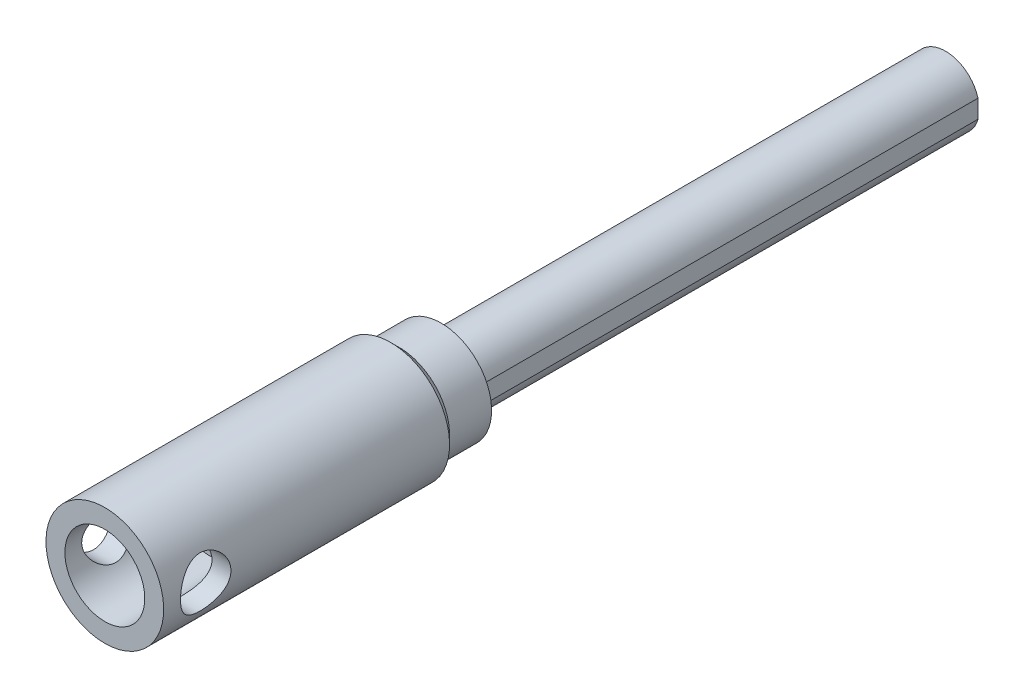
ISO-10303-21;
HEADER;
FILE_DESCRIPTION(('STEP AP214'),'2;1');
FILE_NAME('part.step','',(''),(''),'','','');
FILE_SCHEMA(('AUTOMOTIVE_DESIGN { 1 0 10303 214 1 1 1 1 }'));
ENDSEC;
DATA;
#1=APPLICATION_CONTEXT('core data for automotive mechanical design processes');
#2=APPLICATION_PROTOCOL_DEFINITION('international standard','automotive_design',2000,#1);
#3=PRODUCT_CONTEXT('',#1,'mechanical');
#4=PRODUCT('Part','Part','',(#3));
#5=PRODUCT_RELATED_PRODUCT_CATEGORY('part','',(#4));
#6=PRODUCT_DEFINITION_FORMATION('','',#4);
#7=PRODUCT_DEFINITION_CONTEXT('part definition',#1,'design');
#8=PRODUCT_DEFINITION('design','',#6,#7);
#9=PRODUCT_DEFINITION_SHAPE('','',#8);
#10=(LENGTH_UNIT() NAMED_UNIT(*) SI_UNIT(.MILLI.,.METRE.));
#11=(NAMED_UNIT(*) PLANE_ANGLE_UNIT() SI_UNIT($,.RADIAN.));
#12=(NAMED_UNIT(*) SI_UNIT($,.STERADIAN.) SOLID_ANGLE_UNIT());
#13=UNCERTAINTY_MEASURE_WITH_UNIT(LENGTH_MEASURE(1.E-05),#10,'distance_accuracy_value','');
#14=(GEOMETRIC_REPRESENTATION_CONTEXT(3) GLOBAL_UNCERTAINTY_ASSIGNED_CONTEXT((#13)) GLOBAL_UNIT_ASSIGNED_CONTEXT((#10,
#11,#12)) REPRESENTATION_CONTEXT('',''));
#15=CARTESIAN_POINT('',(0.,0.,0.));
#16=DIRECTION('',(0.,0.,1.));
#17=DIRECTION('',(1.,0.,0.));
#18=AXIS2_PLACEMENT_3D('',#15,#16,#17);
#19=CARTESIAN_POINT('',(2.3094010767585,0.,85.));
#20=DIRECTION('',(-0.866025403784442,0.5,0.));
#21=DIRECTION('',(-0.5,-0.866025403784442,0.));
#22=AXIS2_PLACEMENT_3D('',#19,#20,#21);
#23=PLANE('',#22);
#24=DIRECTION('',(0.,0.,1.));
#25=VECTOR('',#24,1.);
#26=CARTESIAN_POINT('',(1.15470053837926,-2.,85.));
#27=LINE('',#26,#25);
#28=CARTESIAN_POINT('',(1.15470053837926,-2.,85.));
#29=VERTEX_POINT('',#28);
#30=CARTESIAN_POINT('',(1.15470053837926,-2.,87.5));
#31=VERTEX_POINT('',#30);
#32=EDGE_CURVE('E273',#29,#31,#27,.T.);
#33=ORIENTED_EDGE('',*,*,#32,.T.);
#34=DIRECTION('',(-0.5,-0.866025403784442,0.));
#35=VECTOR('',#34,1.);
#36=CARTESIAN_POINT('',(2.3094010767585,0.,87.5));
#37=LINE('',#36,#35);
#38=CARTESIAN_POINT('',(2.3094010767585,0.,87.5));
#39=VERTEX_POINT('',#38);
#40=EDGE_CURVE('E29',#39,#31,#37,.T.);
#41=ORIENTED_EDGE('',*,*,#40,.F.);
#42=DIRECTION('',(0.,0.,1.));
#43=VECTOR('',#42,1.);
#44=CARTESIAN_POINT('',(2.3094010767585,0.,85.));
#45=LINE('',#44,#43);
#46=CARTESIAN_POINT('',(2.3094010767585,0.,85.));
#47=VERTEX_POINT('',#46);
#48=EDGE_CURVE('E33',#47,#39,#45,.T.);
#49=ORIENTED_EDGE('',*,*,#48,.F.);
#50=DIRECTION('',(-0.5,-0.866025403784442,0.));
#51=VECTOR('',#50,1.);
#52=CARTESIAN_POINT('',(2.3094010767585,0.,85.));
#53=LINE('',#52,#51);
#54=EDGE_CURVE('E234',#47,#29,#53,.T.);
#55=ORIENTED_EDGE('',*,*,#54,.T.);
#56=EDGE_LOOP('',(#33,#41,#49,#55));
#57=FACE_BOUND('',#56,.T.);
#58=ADVANCED_FACE('F14',(#57),#23,.T.);
#59=CARTESIAN_POINT('',(-1.15470053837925,-2.,85.));
#60=DIRECTION('',(0.,-1.,0.));
#61=DIRECTION('',(0.,0.,-1.));
#62=AXIS2_PLACEMENT_3D('',#59,#60,#61);
#63=PLANE('',#62);
#64=DIRECTION('',(0.,0.,1.));
#65=VECTOR('',#64,1.);
#66=CARTESIAN_POINT('',(-1.15470053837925,-2.,85.));
#67=LINE('',#66,#65);
#68=CARTESIAN_POINT('',(-1.15470053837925,-2.,85.));
#69=VERTEX_POINT('',#68);
#70=CARTESIAN_POINT('',(-1.15470053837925,-2.,87.5));
#71=VERTEX_POINT('',#70);
#72=EDGE_CURVE('E271',#69,#71,#67,.T.);
#73=ORIENTED_EDGE('',*,*,#72,.T.);
#74=DIRECTION('',(1.,0.,0.));
#75=VECTOR('',#74,1.);
#76=CARTESIAN_POINT('',(-1.15470053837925,-2.,87.5));
#77=LINE('',#76,#75);
#78=EDGE_CURVE('E244',#71,#31,#77,.T.);
#79=ORIENTED_EDGE('',*,*,#78,.T.);
#80=ORIENTED_EDGE('',*,*,#32,.F.);
#81=DIRECTION('',(1.,0.,0.));
#82=VECTOR('',#81,1.);
#83=CARTESIAN_POINT('',(-1.15470053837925,-2.,85.));
#84=LINE('',#83,#82);
#85=EDGE_CURVE('E260',#69,#29,#84,.T.);
#86=ORIENTED_EDGE('',*,*,#85,.F.);
#87=EDGE_LOOP('',(#73,#79,#80,#86));
#88=FACE_BOUND('',#87,.T.);
#89=ADVANCED_FACE('F164',(#88),#63,.F.);
#90=CARTESIAN_POINT('',(-2.3094010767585,0.,85.));
#91=DIRECTION('',(-0.866025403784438,-0.5,0.));
#92=DIRECTION('',(0.5,-0.866025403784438,0.));
#93=AXIS2_PLACEMENT_3D('',#90,#91,#92);
#94=PLANE('',#93);
#95=DIRECTION('',(0.,0.,1.));
#96=VECTOR('',#95,1.);
#97=CARTESIAN_POINT('',(-2.3094010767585,0.,85.));
#98=LINE('',#97,#96);
#99=CARTESIAN_POINT('',(-2.3094010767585,0.,85.));
#100=VERTEX_POINT('',#99);
#101=CARTESIAN_POINT('',(-2.3094010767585,0.,87.5));
#102=VERTEX_POINT('',#101);
#103=EDGE_CURVE('E269',#100,#102,#98,.T.);
#104=ORIENTED_EDGE('',*,*,#103,.T.);
#105=DIRECTION('',(0.5,-0.866025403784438,0.));
#106=VECTOR('',#105,1.);
#107=CARTESIAN_POINT('',(-2.3094010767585,0.,87.5));
#108=LINE('',#107,#106);
#109=EDGE_CURVE('E241',#102,#71,#108,.T.);
#110=ORIENTED_EDGE('',*,*,#109,.T.);
#111=ORIENTED_EDGE('',*,*,#72,.F.);
#112=DIRECTION('',(0.5,-0.866025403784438,0.));
#113=VECTOR('',#112,1.);
#114=CARTESIAN_POINT('',(-2.3094010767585,0.,85.));
#115=LINE('',#114,#113);
#116=EDGE_CURVE('E257',#100,#69,#115,.T.);
#117=ORIENTED_EDGE('',*,*,#116,.F.);
#118=EDGE_LOOP('',(#104,#110,#111,#117));
#119=FACE_BOUND('',#118,.T.);
#120=ADVANCED_FACE('F169',(#119),#94,.F.);
#121=CARTESIAN_POINT('',(-2.3094010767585,0.,85.));
#122=DIRECTION('',(0.866025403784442,-0.5,0.));
#123=DIRECTION('',(0.5,0.866025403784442,0.));
#124=AXIS2_PLACEMENT_3D('',#121,#122,#123);
#125=PLANE('',#124);
#126=DIRECTION('',(0.,0.,1.));
#127=VECTOR('',#126,1.);
#128=CARTESIAN_POINT('',(-1.15470053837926,2.,85.));
#129=LINE('',#128,#127);
#130=CARTESIAN_POINT('',(-1.15470053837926,2.,85.));
#131=VERTEX_POINT('',#130);
#132=CARTESIAN_POINT('',(-1.15470053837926,2.,87.5));
#133=VERTEX_POINT('',#132);
#134=EDGE_CURVE('E267',#131,#133,#129,.T.);
#135=ORIENTED_EDGE('',*,*,#134,.T.);
#136=DIRECTION('',(0.5,0.866025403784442,0.));
#137=VECTOR('',#136,1.);
#138=CARTESIAN_POINT('',(-2.3094010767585,0.,87.5));
#139=LINE('',#138,#137);
#140=EDGE_CURVE('E238',#102,#133,#139,.T.);
#141=ORIENTED_EDGE('',*,*,#140,.F.);
#142=ORIENTED_EDGE('',*,*,#103,.F.);
#143=DIRECTION('',(0.5,0.866025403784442,0.));
#144=VECTOR('',#143,1.);
#145=CARTESIAN_POINT('',(-2.3094010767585,0.,85.));
#146=LINE('',#145,#144);
#147=EDGE_CURVE('E254',#100,#131,#146,.T.);
#148=ORIENTED_EDGE('',*,*,#147,.T.);
#149=EDGE_LOOP('',(#135,#141,#142,#148));
#150=FACE_BOUND('',#149,.T.);
#151=ADVANCED_FACE('F183',(#150),#125,.T.);
#152=CARTESIAN_POINT('',(1.15470053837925,2.,85.));
#153=DIRECTION('',(0.,1.,0.));
#154=DIRECTION('',(-1.,0.,0.));
#155=AXIS2_PLACEMENT_3D('',#152,#153,#154);
#156=PLANE('',#155);
#157=DIRECTION('',(0.,0.,1.));
#158=VECTOR('',#157,1.);
#159=CARTESIAN_POINT('',(1.15470053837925,2.,85.));
#160=LINE('',#159,#158);
#161=CARTESIAN_POINT('',(1.15470053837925,2.,85.));
#162=VERTEX_POINT('',#161);
#163=CARTESIAN_POINT('',(1.15470053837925,2.,87.5));
#164=VERTEX_POINT('',#163);
#165=EDGE_CURVE('E265',#162,#164,#160,.T.);
#166=ORIENTED_EDGE('',*,*,#165,.T.);
#167=DIRECTION('',(-1.,0.,0.));
#168=VECTOR('',#167,1.);
#169=CARTESIAN_POINT('',(1.15470053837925,2.,87.5));
#170=LINE('',#169,#168);
#171=EDGE_CURVE('E235',#164,#133,#170,.T.);
#172=ORIENTED_EDGE('',*,*,#171,.T.);
#173=ORIENTED_EDGE('',*,*,#134,.F.);
#174=DIRECTION('',(-1.,0.,0.));
#175=VECTOR('',#174,1.);
#176=CARTESIAN_POINT('',(1.15470053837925,2.,85.));
#177=LINE('',#176,#175);
#178=EDGE_CURVE('E251',#162,#131,#177,.T.);
#179=ORIENTED_EDGE('',*,*,#178,.F.);
#180=EDGE_LOOP('',(#166,#172,#173,#179));
#181=FACE_BOUND('',#180,.T.);
#182=ADVANCED_FACE('F179',(#181),#156,.F.);
#183=CARTESIAN_POINT('',(2.3094010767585,0.,85.));
#184=DIRECTION('',(0.866025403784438,0.5,0.));
#185=DIRECTION('',(-0.5,0.866025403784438,0.));
#186=AXIS2_PLACEMENT_3D('',#183,#184,#185);
#187=PLANE('',#186);
#188=DIRECTION('',(-0.5,0.866025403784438,0.));
#189=VECTOR('',#188,1.);
#190=CARTESIAN_POINT('',(2.3094010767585,0.,85.));
#191=LINE('',#190,#189);
#192=EDGE_CURVE('E248',#47,#162,#191,.T.);
#193=ORIENTED_EDGE('',*,*,#192,.F.);
#194=ORIENTED_EDGE('',*,*,#48,.T.);
#195=DIRECTION('',(-0.5,0.866025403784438,0.));
#196=VECTOR('',#195,1.);
#197=CARTESIAN_POINT('',(2.3094010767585,0.,87.5));
#198=LINE('',#197,#196);
#199=EDGE_CURVE('E231',#39,#164,#198,.T.);
#200=ORIENTED_EDGE('',*,*,#199,.T.);
#201=ORIENTED_EDGE('',*,*,#165,.F.);
#202=EDGE_LOOP('',(#193,#194,#200,#201));
#203=FACE_BOUND('',#202,.T.);
#204=ADVANCED_FACE('F176',(#203),#187,.F.);
#205=CARTESIAN_POINT('',(3.46410161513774,2.,85.));
#206=DIRECTION('',(0.,0.,-1.));
#207=DIRECTION('',(0.,1.,0.));
#208=AXIS2_PLACEMENT_3D('',#205,#206,#207);
#209=PLANE('',#208);
#210=ORIENTED_EDGE('',*,*,#54,.F.);
#211=ORIENTED_EDGE('',*,*,#192,.T.);
#212=ORIENTED_EDGE('',*,*,#178,.T.);
#213=ORIENTED_EDGE('',*,*,#147,.F.);
#214=ORIENTED_EDGE('',*,*,#116,.T.);
#215=ORIENTED_EDGE('',*,*,#85,.T.);
#216=EDGE_LOOP('',(#210,#211,#212,#213,#214,#215));
#217=FACE_BOUND('',#216,.T.);
#218=ADVANCED_FACE('F174',(#217),#209,.F.);
#219=CARTESIAN_POINT('',(0.,0.,87.5));
#220=DIRECTION('',(0.,0.,1.));
#221=DIRECTION('',(0.,-1.,0.));
#222=AXIS2_PLACEMENT_3D('',#219,#220,#221);
#223=PLANE('',#222);
#224=CARTESIAN_POINT('',(0.,0.,87.5));
#225=DIRECTION('',(0.,0.,1.));
#226=DIRECTION('',(0.,-1.,0.));
#227=AXIS2_PLACEMENT_3D('',#224,#225,#226);
#228=CIRCLE('',#227,4.25);
#229=CARTESIAN_POINT('',(0.,-4.25,87.5));
#230=VERTEX_POINT('',#229);
#231=EDGE_CURVE('E9',#230,#230,#228,.T.);
#232=ORIENTED_EDGE('',*,*,#231,.T.);
#233=EDGE_LOOP('',(#232));
#234=FACE_BOUND('',#233,.T.);
#235=ORIENTED_EDGE('',*,*,#199,.F.);
#236=ORIENTED_EDGE('',*,*,#40,.T.);
#237=ORIENTED_EDGE('',*,*,#78,.F.);
#238=ORIENTED_EDGE('',*,*,#109,.F.);
#239=ORIENTED_EDGE('',*,*,#140,.T.);
#240=ORIENTED_EDGE('',*,*,#171,.F.);
#241=EDGE_LOOP('',(#235,#236,#237,#238,#239,#240));
#242=FACE_BOUND('',#241,.T.);
#243=ADVANCED_FACE('F16',(#234,#242),#223,.T.);
#244=CARTESIAN_POINT('',(0.,0.,82.5));
#245=DIRECTION('',(0.,0.,1.));
#246=DIRECTION('',(0.,-1.,0.));
#247=AXIS2_PLACEMENT_3D('',#244,#245,#246);
#248=CYLINDRICAL_SURFACE('',#247,4.25);
#249=CARTESIAN_POINT('',(0.,0.,82.5));
#250=DIRECTION('',(0.,0.,1.));
#251=DIRECTION('',(0.,-1.,0.));
#252=AXIS2_PLACEMENT_3D('',#249,#250,#251);
#253=CIRCLE('',#252,4.25);
#254=CARTESIAN_POINT('',(0.,-4.25,82.5));
#255=VERTEX_POINT('',#254);
#256=EDGE_CURVE('E22',#255,#255,#253,.T.);
#257=ORIENTED_EDGE('',*,*,#256,.T.);
#258=EDGE_LOOP('',(#257));
#259=FACE_BOUND('',#258,.T.);
#260=ORIENTED_EDGE('',*,*,#231,.F.);
#261=EDGE_LOOP('',(#260));
#262=FACE_BOUND('',#261,.T.);
#263=ADVANCED_FACE('F190',(#259,#262),#248,.T.);
#264=CARTESIAN_POINT('',(0.,0.,0.));
#265=DIRECTION('',(0.,0.,1.));
#266=DIRECTION('',(-1.,0.,0.));
#267=AXIS2_PLACEMENT_3D('',#264,#265,#266);
#268=PLANE('',#267);
#269=DIRECTION('',(0.,-1.,0.));
#270=VECTOR('',#269,1.);
#271=CARTESIAN_POINT('',(3.85,-1.08512672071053,0.));
#272=LINE('',#271,#270);
#273=CARTESIAN_POINT('',(3.85,1.08512672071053,0.));
#274=VERTEX_POINT('',#273);
#275=CARTESIAN_POINT('',(3.85,-1.08512672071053,0.));
#276=VERTEX_POINT('',#275);
#277=EDGE_CURVE('E91',#274,#276,#272,.T.);
#278=ORIENTED_EDGE('',*,*,#277,.T.);
#279=CARTESIAN_POINT('',(0.,0.,0.));
#280=DIRECTION('',(0.,0.,1.));
#281=DIRECTION('',(-1.,0.,0.));
#282=AXIS2_PLACEMENT_3D('',#279,#280,#281);
#283=CIRCLE('',#282,4.);
#284=EDGE_CURVE('E83',#274,#276,#283,.T.);
#285=ORIENTED_EDGE('',*,*,#284,.F.);
#286=EDGE_LOOP('',(#278,#285));
#287=FACE_BOUND('',#286,.T.);
#288=ADVANCED_FACE('F95',(#287),#268,.F.);
#289=CARTESIAN_POINT('',(3.85,-1.08512672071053,70.));
#290=DIRECTION('',(1.,0.,0.));
#291=DIRECTION('',(0.,0.,1.));
#292=AXIS2_PLACEMENT_3D('',#289,#290,#291);
#293=PLANE('',#292);
#294=DIRECTION('',(0.,1.,0.));
#295=VECTOR('',#294,1.);
#296=CARTESIAN_POINT('',(3.85,5.9999999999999,60.));
#297=LINE('',#296,#295);
#298=CARTESIAN_POINT('',(3.85,-1.08512672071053,60.));
#299=VERTEX_POINT('',#298);
#300=CARTESIAN_POINT('',(3.85,1.08512672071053,60.));
#301=VERTEX_POINT('',#300);
#302=EDGE_CURVE('E226',#299,#301,#297,.T.);
#303=ORIENTED_EDGE('',*,*,#302,.F.);
#304=DIRECTION('',(0.,0.,-1.));
#305=VECTOR('',#304,1.);
#306=CARTESIAN_POINT('',(3.85,-1.08512672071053,70.));
#307=LINE('',#306,#305);
#308=EDGE_CURVE('E88',#299,#276,#307,.T.);
#309=ORIENTED_EDGE('',*,*,#308,.T.);
#310=ORIENTED_EDGE('',*,*,#277,.F.);
#311=DIRECTION('',(0.,0.,-1.));
#312=VECTOR('',#311,1.);
#313=CARTESIAN_POINT('',(3.85,1.08512672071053,70.));
#314=LINE('',#313,#312);
#315=EDGE_CURVE('E78',#301,#274,#314,.T.);
#316=ORIENTED_EDGE('',*,*,#315,.F.);
#317=EDGE_LOOP('',(#303,#309,#310,#316));
#318=FACE_BOUND('',#317,.T.);
#319=ADVANCED_FACE('F92',(#318),#293,.T.);
#320=CARTESIAN_POINT('',(0.,0.,70.));
#321=DIRECTION('',(0.,0.,-1.));
#322=DIRECTION('',(1.,0.,0.));
#323=AXIS2_PLACEMENT_3D('',#320,#321,#322);
#324=CYLINDRICAL_SURFACE('',#323,4.);
#325=ORIENTED_EDGE('',*,*,#308,.F.);
#326=CARTESIAN_POINT('',(0.,0.,60.));
#327=DIRECTION('',(0.,0.,1.));
#328=DIRECTION('',(-6.15310496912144E-10,1.,0.));
#329=AXIS2_PLACEMENT_3D('',#326,#327,#328);
#330=CIRCLE('',#329,4.);
#331=EDGE_CURVE('E84',#299,#301,#330,.F.);
#332=ORIENTED_EDGE('',*,*,#331,.T.);
#333=ORIENTED_EDGE('',*,*,#315,.T.);
#334=ORIENTED_EDGE('',*,*,#284,.T.);
#335=EDGE_LOOP('',(#325,#332,#333,#334));
#336=FACE_BOUND('',#335,.T.);
#337=ADVANCED_FACE('F81',(#336),#324,.T.);
#338=CARTESIAN_POINT('',(0.,5.99999999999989,60.));
#339=DIRECTION('',(0.,0.,1.));
#340=DIRECTION('',(0.,-1.,0.));
#341=AXIS2_PLACEMENT_3D('',#338,#339,#340);
#342=PLANE('',#341);
#343=CARTESIAN_POINT('',(0.,0.,60.));
#344=DIRECTION('',(0.,0.,1.));
#345=DIRECTION('',(0.,-1.,0.));
#346=AXIS2_PLACEMENT_3D('',#343,#344,#345);
#347=CIRCLE('',#346,5.99999999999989);
#348=CARTESIAN_POINT('',(0.,-5.99999999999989,60.));
#349=VERTEX_POINT('',#348);
#350=EDGE_CURVE('E221',#349,#349,#347,.T.);
#351=ORIENTED_EDGE('',*,*,#350,.F.);
#352=EDGE_LOOP('',(#351));
#353=FACE_BOUND('',#352,.T.);
#354=ORIENTED_EDGE('',*,*,#331,.F.);
#355=ORIENTED_EDGE('',*,*,#302,.T.);
#356=EDGE_LOOP('',(#354,#355));
#357=FACE_BOUND('',#356,.T.);
#358=ADVANCED_FACE('F327',(#353,#357),#342,.F.);
#359=CARTESIAN_POINT('',(0.,0.,102.759686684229));
#360=DIRECTION('',(0.,0.,1.));
#361=DIRECTION('',(0.,-1.,0.));
#362=AXIS2_PLACEMENT_3D('',#359,#360,#361);
#363=CYLINDRICAL_SURFACE('',#362,5.99999999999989);
#364=CARTESIAN_POINT('',(0.,0.,65.));
#365=DIRECTION('',(0.,0.,1.));
#366=DIRECTION('',(0.,-1.,0.));
#367=AXIS2_PLACEMENT_3D('',#364,#365,#366);
#368=CIRCLE('',#367,5.99999999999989);
#369=CARTESIAN_POINT('',(0.,-5.99999999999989,65.));
#370=VERTEX_POINT('',#369);
#371=EDGE_CURVE('E219',#370,#370,#368,.T.);
#372=ORIENTED_EDGE('',*,*,#371,.F.);
#373=EDGE_LOOP('',(#372));
#374=FACE_BOUND('',#373,.T.);
#375=ORIENTED_EDGE('',*,*,#350,.T.);
#376=EDGE_LOOP('',(#375));
#377=FACE_BOUND('',#376,.T.);
#378=ADVANCED_FACE('F335',(#374,#377),#363,.T.);
#379=CARTESIAN_POINT('',(0.,0.,66.));
#380=DIRECTION('',(0.,0.,1.));
#381=DIRECTION('',(0.,-1.,0.));
#382=AXIS2_PLACEMENT_3D('',#379,#380,#381);
#383=CONICAL_SURFACE('',#382,7.0000000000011,0.78539816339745);
#384=ORIENTED_EDGE('',*,*,#371,.T.);
#385=EDGE_LOOP('',(#384));
#386=FACE_BOUND('',#385,.T.);
#387=CARTESIAN_POINT('',(0.,0.,66.));
#388=DIRECTION('',(0.,0.,1.));
#389=DIRECTION('',(0.,-1.,0.));
#390=AXIS2_PLACEMENT_3D('',#387,#388,#389);
#391=CIRCLE('',#390,7.0000000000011);
#392=CARTESIAN_POINT('',(0.,-7.0000000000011,66.));
#393=VERTEX_POINT('',#392);
#394=EDGE_CURVE('E145',#393,#393,#391,.T.);
#395=ORIENTED_EDGE('',*,*,#394,.F.);
#396=EDGE_LOOP('',(#395));
#397=FACE_BOUND('',#396,.T.);
#398=ADVANCED_FACE('F128',(#386,#397),#383,.T.);
#399=CARTESIAN_POINT('',(0.,0.,102.759686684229));
#400=DIRECTION('',(0.,0.,1.));
#401=DIRECTION('',(0.,-1.,0.));
#402=AXIS2_PLACEMENT_3D('',#399,#400,#401);
#403=CYLINDRICAL_SURFACE('',#402,7.0000000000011);
#404=ORIENTED_EDGE('',*,*,#394,.T.);
#405=EDGE_LOOP('',(#404));
#406=FACE_BOUND('',#405,.T.);
#407=CARTESIAN_POINT('',(-7.0000000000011,1.09818090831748E-12,98.));
#408=CARTESIAN_POINT('',(-6.99999408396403,-0.160281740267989,97.9999925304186));
#409=CARTESIAN_POINT('',(-6.9944325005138,-0.320833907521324,97.9870786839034));
#410=CARTESIAN_POINT('',(-6.97273920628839,-0.637349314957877,97.9359176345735));
#411=CARTESIAN_POINT('',(-6.95658080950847,-0.793299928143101,97.8976064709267));
#412=CARTESIAN_POINT('',(-6.91541630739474,-1.09553470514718,97.7973302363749));
#413=CARTESIAN_POINT('',(-6.89044089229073,-1.24185033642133,97.7354471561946));
#414=CARTESIAN_POINT('',(-6.83405660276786,-1.52187332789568,97.5901355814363));
#415=CARTESIAN_POINT('',(-6.80264947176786,-1.65558409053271,97.5067129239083));
#416=CARTESIAN_POINT('',(-6.73467821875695,-1.91384144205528,97.3160723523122));
#417=CARTESIAN_POINT('',(-6.6979389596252,-2.03764045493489,97.2079047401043));
#418=CARTESIAN_POINT('',(-6.62417654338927,-2.26599040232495,96.9728561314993));
#419=CARTESIAN_POINT('',(-6.58715324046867,-2.37053065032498,96.8459648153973));
#420=CARTESIAN_POINT('',(-6.51482055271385,-2.56285686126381,96.5689672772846));
#421=CARTESIAN_POINT('',(-6.47970460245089,-2.64946811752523,96.4179895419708));
#422=CARTESIAN_POINT('',(-6.41796168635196,-2.79573199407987,96.1018905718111));
#423=CARTESIAN_POINT('',(-6.39133010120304,-2.85539929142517,95.9367770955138));
#424=CARTESIAN_POINT('',(-6.35147799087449,-2.94294919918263,95.6056992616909));
#425=CARTESIAN_POINT('',(-6.33765221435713,-2.97227494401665,95.4401922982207));
#426=CARTESIAN_POINT('',(-6.32324849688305,-3.00280607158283,95.1060740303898));
#427=CARTESIAN_POINT('',(-6.32266262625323,-3.00402828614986,94.9374646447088));
#428=CARTESIAN_POINT('',(-6.33429573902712,-2.97939999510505,94.6167000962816));
#429=CARTESIAN_POINT('',(-6.34546870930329,-2.95576113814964,94.4643293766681));
#430=CARTESIAN_POINT('',(-6.37758411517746,-2.8858077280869,94.1659724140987));
#431=CARTESIAN_POINT('',(-6.39852855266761,-2.83948852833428,94.0199874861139));
#432=CARTESIAN_POINT('',(-6.44830685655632,-2.72457659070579,93.7347528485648));
#433=CARTESIAN_POINT('',(-6.47730295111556,-2.65551974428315,93.5957197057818));
#434=CARTESIAN_POINT('',(-6.5398849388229,-2.497423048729,93.3306536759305));
#435=CARTESIAN_POINT('',(-6.57347269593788,-2.40837507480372,93.2046261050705));
#436=CARTESIAN_POINT('',(-6.64512404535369,-2.20343405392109,92.9572224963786));
#437=CARTESIAN_POINT('',(-6.68331855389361,-2.08584728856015,92.8372832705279));
#438=CARTESIAN_POINT('',(-6.75734605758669,-1.83187332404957,92.618328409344));
#439=CARTESIAN_POINT('',(-6.79317843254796,-1.69548121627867,92.5193182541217));
#440=CARTESIAN_POINT('',(-6.85959693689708,-1.40318582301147,92.342756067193));
#441=CARTESIAN_POINT('',(-6.89002455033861,-1.24687114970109,92.2658209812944));
#442=CARTESIAN_POINT('',(-6.94097396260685,-0.921879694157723,92.1398497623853));
#443=CARTESIAN_POINT('',(-6.96150156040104,-0.753210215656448,92.0907972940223));
#444=CARTESIAN_POINT('',(-6.98923526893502,-0.42027623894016,92.0250661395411));
#445=CARTESIAN_POINT('',(-6.99723249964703,-0.256457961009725,92.0064612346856));
#446=CARTESIAN_POINT('',(-7.00155416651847,0.0721433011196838,91.9963704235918));
#447=CARTESIAN_POINT('',(-6.99788220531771,0.23692597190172,92.0048761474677));
#448=CARTESIAN_POINT('',(-6.97978676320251,0.553542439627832,92.0474156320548));
#449=CARTESIAN_POINT('',(-6.96594519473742,0.705598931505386,92.0800683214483));
#450=CARTESIAN_POINT('',(-6.92953888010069,1.00189113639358,92.1680208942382));
#451=CARTESIAN_POINT('',(-6.90697304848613,1.14612587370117,92.2233235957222));
#452=CARTESIAN_POINT('',(-6.85438751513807,1.42777696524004,92.3568011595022));
#453=CARTESIAN_POINT('',(-6.8241570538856,1.56483974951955,92.4356363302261));
#454=CARTESIAN_POINT('',(-6.7594298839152,1.82428490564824,92.613218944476));
#455=CARTESIAN_POINT('',(-6.72493135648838,1.94666097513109,92.7119748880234));
#456=CARTESIAN_POINT('',(-6.6521478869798,2.18296759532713,92.935289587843));
#457=CARTESIAN_POINT('',(-6.61377354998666,2.29556617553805,93.0612322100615));
#458=CARTESIAN_POINT('',(-6.53984037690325,2.49843431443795,93.3307822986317));
#459=CARTESIAN_POINT('',(-6.50428232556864,2.58869766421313,93.474394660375));
#460=CARTESIAN_POINT('',(-6.4396296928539,2.74563875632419,93.7788138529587));
#461=CARTESIAN_POINT('',(-6.41066255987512,2.81186415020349,93.9398830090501));
#462=CARTESIAN_POINT('',(-6.36413607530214,2.91565885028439,94.2725263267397));
#463=CARTESIAN_POINT('',(-6.34656658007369,2.95325364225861,94.4440909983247));
#464=CARTESIAN_POINT('',(-6.3264348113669,2.99611948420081,94.7779911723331));
#465=CARTESIAN_POINT('',(-6.3227792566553,3.00374693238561,94.9399592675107));
#466=CARTESIAN_POINT('',(-6.32795618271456,2.99282649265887,95.2627897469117));
#467=CARTESIAN_POINT('',(-6.33678646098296,2.97428322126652,95.4236523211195));
#468=CARTESIAN_POINT('',(-6.36491653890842,2.91356431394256,95.7310416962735));
#469=CARTESIAN_POINT('',(-6.3836471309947,2.87266975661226,95.8778787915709));
#470=CARTESIAN_POINT('',(-6.42898875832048,2.76970222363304,96.162620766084));
#471=CARTESIAN_POINT('',(-6.4556020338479,2.70762322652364,96.3005230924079));
#472=CARTESIAN_POINT('',(-6.51575247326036,2.55963250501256,96.5728207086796));
#473=CARTESIAN_POINT('',(-6.54961649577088,2.47248232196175,96.7064691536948));
#474=CARTESIAN_POINT('',(-6.61959778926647,2.27849600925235,96.9579823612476));
#475=CARTESIAN_POINT('',(-6.65571590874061,2.17165243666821,97.0758411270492));
#476=CARTESIAN_POINT('',(-6.72955424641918,1.9313504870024,97.3020036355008));
#477=CARTESIAN_POINT('',(-6.76717599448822,1.79645724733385,97.4088195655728));
#478=CARTESIAN_POINT('',(-6.83696477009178,1.50919760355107,97.5984397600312));
#479=CARTESIAN_POINT('',(-6.86912932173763,1.35682332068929,97.6812331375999));
#480=CARTESIAN_POINT('',(-6.91035442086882,1.11954532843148,97.7845926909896));
#481=CARTESIAN_POINT('',(-6.92286397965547,1.03957288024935,97.8154332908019));
#482=CARTESIAN_POINT('',(-6.94533202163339,0.876970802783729,97.8702382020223));
#483=CARTESIAN_POINT('',(-6.9552917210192,0.794342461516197,97.8942057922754));
#484=CARTESIAN_POINT('',(-6.97234378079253,0.62726556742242,97.9349477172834));
#485=CARTESIAN_POINT('',(-6.97944312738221,0.542821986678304,97.9517395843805));
#486=CARTESIAN_POINT('',(-6.99059319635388,0.372647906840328,97.9780087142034));
#487=CARTESIAN_POINT('',(-6.99464610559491,0.286918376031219,97.987491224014));
#488=CARTESIAN_POINT('',(-6.99807592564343,0.167492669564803,97.9955082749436));
#489=CARTESIAN_POINT('',(-6.9987967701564,0.134021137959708,97.9971918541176));
#490=CARTESIAN_POINT('',(-6.9997594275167,0.0670370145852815,97.9994385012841));
#491=CARTESIAN_POINT('',(-7.00000123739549,0.0335244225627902,98.0000015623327));
#492=CARTESIAN_POINT('',(-7.0000000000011,1.09818090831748E-12,98.));
#493=B_SPLINE_CURVE_WITH_KNOTS('',3,(#407,#408,#409,#410,#411,#412,#413,#414,#415,#416,#417,
#418,#419,#420,#421,#422,#423,#424,#425,#426,#427,#428,#429,#430,#431,#432,#433,#434,#435,#436,
#437,#438,#439,#440,#441,#442,#443,#444,#445,#446,#447,#448,#449,#450,#451,#452,#453,#454,#455,
#456,#457,#458,#459,#460,#461,#462,#463,#464,#465,#466,#467,#468,#469,#470,#471,#472,#473,#474,
#475,#476,#477,#478,#479,#480,#481,#482,#483,#484,#485,#486,#487,#488,#489,#490,#491,#492),
.UNSPECIFIED.,.T.,.F.,(4,2,2,2,2,2,2,2,2,2,2,2,2,2,2,2,2,2,2,2,2,2,2,2,2,2,2,2,2,2,2,2,2,2,2,2,
2,2,2,2,2,2,4),(0.,0.480714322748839,0.962643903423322,1.44291226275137,1.92305060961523,
2.42622743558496,2.9296826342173,3.45969560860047,3.98941952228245,4.4925942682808,
4.99546764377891,5.4571072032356,5.91884138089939,6.39065408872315,6.86265889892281,
7.37709837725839,7.89167239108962,8.41947244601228,8.94696296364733,9.43957347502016,
9.93203191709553,10.3983119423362,10.8646499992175,11.345550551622,11.8266567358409,
12.3440285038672,12.8615439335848,13.3883469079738,13.9146803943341,14.3986848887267,
14.8826040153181,15.341320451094,15.8001673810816,16.2874475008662,16.7749121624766,
17.3008416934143,17.8270092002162,18.0865840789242,18.34603491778,18.6048481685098,
18.8634754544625,18.9640207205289,19.0645666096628),.UNSPECIFIED.);
#494=CARTESIAN_POINT('',(-7.0000000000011,1.09818090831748E-12,98.));
#495=VERTEX_POINT('',#494);
#496=EDGE_CURVE('E111',#495,#495,#493,.T.);
#497=ORIENTED_EDGE('',*,*,#496,.T.);
#498=EDGE_LOOP('',(#497));
#499=FACE_BOUND('',#498,.T.);
#500=CARTESIAN_POINT('',(7.0000000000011,1.1500207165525E-12,98.));
#501=CARTESIAN_POINT('',(6.99999408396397,0.160281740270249,97.9999925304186));
#502=CARTESIAN_POINT('',(6.9944325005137,0.320833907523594,97.9870786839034));
#503=CARTESIAN_POINT('',(6.97273920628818,0.637349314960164,97.9359176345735));
#504=CARTESIAN_POINT('',(6.95658080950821,0.793299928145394,97.8976064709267));
#505=CARTESIAN_POINT('',(6.91541630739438,1.09553470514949,97.7973302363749));
#506=CARTESIAN_POINT('',(6.89044089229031,1.24185033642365,97.7354471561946));
#507=CARTESIAN_POINT('',(6.83405660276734,1.52187332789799,97.5901355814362));
#508=CARTESIAN_POINT('',(6.80264947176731,1.65558409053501,97.5067129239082));
#509=CARTESIAN_POINT('',(6.7346782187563,1.91384144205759,97.3160723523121));
#510=CARTESIAN_POINT('',(6.6979389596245,2.03764045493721,97.2079047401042));
#511=CARTESIAN_POINT('',(6.62417654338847,2.26599040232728,96.9728561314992));
#512=CARTESIAN_POINT('',(6.58715324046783,2.37053065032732,96.8459648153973));
#513=CARTESIAN_POINT('',(6.51482055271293,2.56285686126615,96.5689672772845));
#514=CARTESIAN_POINT('',(6.47970460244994,2.64946811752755,96.4179895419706));
#515=CARTESIAN_POINT('',(6.41796168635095,2.79573199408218,96.1018905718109));
#516=CARTESIAN_POINT('',(6.39133010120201,2.85539929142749,95.9367770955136));
#517=CARTESIAN_POINT('',(6.35147799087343,2.94294919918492,95.6056992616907));
#518=CARTESIAN_POINT('',(6.33765221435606,2.97227494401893,95.4401922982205));
#519=CARTESIAN_POINT('',(6.32324849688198,3.00280607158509,95.1060740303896));
#520=CARTESIAN_POINT('',(6.32266262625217,3.00402828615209,94.9374646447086));
#521=CARTESIAN_POINT('',(6.33429573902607,2.97939999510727,94.6167000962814));
#522=CARTESIAN_POINT('',(6.34546870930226,2.95576113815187,94.464329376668));
#523=CARTESIAN_POINT('',(6.37758411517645,2.88580772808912,94.1659724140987));
#524=CARTESIAN_POINT('',(6.39852855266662,2.8394885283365,94.0199874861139));
#525=CARTESIAN_POINT('',(6.44830685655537,2.72457659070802,93.7347528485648));
#526=CARTESIAN_POINT('',(6.47730295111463,2.65551974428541,93.5957197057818));
#527=CARTESIAN_POINT('',(6.53988493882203,2.49742304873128,93.3306536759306));
#528=CARTESIAN_POINT('',(6.57347269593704,2.40837507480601,93.2046261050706));
#529=CARTESIAN_POINT('',(6.64512404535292,2.2034340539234,92.9572224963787));
#530=CARTESIAN_POINT('',(6.68331855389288,2.08584728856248,92.837283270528));
#531=CARTESIAN_POINT('',(6.75734605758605,1.83187332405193,92.6183284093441));
#532=CARTESIAN_POINT('',(6.79317843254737,1.69548121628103,92.5193182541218));
#533=CARTESIAN_POINT('',(6.85959693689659,1.40318582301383,92.3427560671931));
#534=CARTESIAN_POINT('',(6.89002455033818,1.24687114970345,92.2658209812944));
#535=CARTESIAN_POINT('',(6.94097396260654,0.921879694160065,92.1398497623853));
#536=CARTESIAN_POINT('',(6.96150156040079,0.753210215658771,92.0907972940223));
#537=CARTESIAN_POINT('',(6.98923526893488,0.420276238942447,92.0250661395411));
#538=CARTESIAN_POINT('',(6.99723249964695,0.256457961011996,92.0064612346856));
#539=CARTESIAN_POINT('',(7.00155416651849,-0.0721433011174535,91.9963704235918));
#540=CARTESIAN_POINT('',(6.99788220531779,-0.236925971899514,92.0048761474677));
#541=CARTESIAN_POINT('',(6.97978676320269,-0.55354243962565,92.0474156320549));
#542=CARTESIAN_POINT('',(6.96594519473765,-0.705598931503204,92.0800683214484));
#543=CARTESIAN_POINT('',(6.929538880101,-1.00189113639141,92.1680208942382));
#544=CARTESIAN_POINT('',(6.90697304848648,-1.14612587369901,92.2233235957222));
#545=CARTESIAN_POINT('',(6.85438751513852,-1.42777696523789,92.3568011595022));
#546=CARTESIAN_POINT('',(6.82415705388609,-1.56483974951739,92.4356363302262));
#547=CARTESIAN_POINT('',(6.75942988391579,-1.82428490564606,92.6132189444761));
#548=CARTESIAN_POINT('',(6.72493135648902,-1.9466609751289,92.7119748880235));
#549=CARTESIAN_POINT('',(6.65214788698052,-2.18296759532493,92.9352895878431));
#550=CARTESIAN_POINT('',(6.61377354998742,-2.29556617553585,93.0612322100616));
#551=CARTESIAN_POINT('',(6.53984037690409,-2.49843431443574,93.3307822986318));
#552=CARTESIAN_POINT('',(6.50428232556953,-2.5886976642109,93.474394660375));
#553=CARTESIAN_POINT('',(6.43962969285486,-2.74563875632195,93.7788138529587));
#554=CARTESIAN_POINT('',(6.41066255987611,-2.81186415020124,93.9398830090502));
#555=CARTESIAN_POINT('',(6.36413607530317,-2.91565885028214,94.2725263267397));
#556=CARTESIAN_POINT('',(6.34656658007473,-2.95325364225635,94.4440909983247));
#557=CARTESIAN_POINT('',(6.32643481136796,-2.99611948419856,94.7779911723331));
#558=CARTESIAN_POINT('',(6.32277925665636,-3.00374693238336,94.9399592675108));
#559=CARTESIAN_POINT('',(6.32795618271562,-2.99282649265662,95.2627897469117));
#560=CARTESIAN_POINT('',(6.33678646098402,-2.97428322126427,95.4236523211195));
#561=CARTESIAN_POINT('',(6.36491653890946,-2.91356431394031,95.7310416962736));
#562=CARTESIAN_POINT('',(6.38364713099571,-2.87266975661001,95.877878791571));
#563=CARTESIAN_POINT('',(6.42898875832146,-2.76970222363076,96.1626207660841));
#564=CARTESIAN_POINT('',(6.45560203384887,-2.70762322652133,96.300523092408));
#565=CARTESIAN_POINT('',(6.51575247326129,-2.55963250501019,96.5728207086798));
#566=CARTESIAN_POINT('',(6.54961649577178,-2.47248232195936,96.706469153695));
#567=CARTESIAN_POINT('',(6.6195977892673,-2.27849600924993,96.9579823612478));
#568=CARTESIAN_POINT('',(6.6557159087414,-2.17165243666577,97.0758411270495));
#569=CARTESIAN_POINT('',(6.72955424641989,-1.93135048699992,97.302003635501));
#570=CARTESIAN_POINT('',(6.76717599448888,-1.79645724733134,97.408819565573));
#571=CARTESIAN_POINT('',(6.83696477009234,-1.50919760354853,97.5984397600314));
#572=CARTESIAN_POINT('',(6.86912932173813,-1.35682332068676,97.6812331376));
#573=CARTESIAN_POINT('',(6.91035442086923,-1.11954532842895,97.7845926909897));
#574=CARTESIAN_POINT('',(6.92286397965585,-1.03957288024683,97.815433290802));
#575=CARTESIAN_POINT('',(6.9453320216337,-0.87697080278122,97.8702382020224));
#576=CARTESIAN_POINT('',(6.95529172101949,-0.794342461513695,97.8942057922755));
#577=CARTESIAN_POINT('',(6.97234378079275,-0.627265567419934,97.9349477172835));
#578=CARTESIAN_POINT('',(6.97944312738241,-0.542821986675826,97.9517395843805));
#579=CARTESIAN_POINT('',(6.99059319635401,-0.372647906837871,97.9780087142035));
#580=CARTESIAN_POINT('',(6.99464610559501,-0.286918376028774,97.987491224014));
#581=CARTESIAN_POINT('',(6.99807592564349,-0.167492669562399,97.9955082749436));
#582=CARTESIAN_POINT('',(6.99879677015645,-0.134021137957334,97.9971918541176));
#583=CARTESIAN_POINT('',(6.99975942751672,-0.0670370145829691,97.9994385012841));
#584=CARTESIAN_POINT('',(7.00000123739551,-0.0335244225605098,98.0000015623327));
#585=CARTESIAN_POINT('',(7.0000000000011,1.1500207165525E-12,98.));
#586=B_SPLINE_CURVE_WITH_KNOTS('',3,(#500,#501,#502,#503,#504,#505,#506,#507,#508,#509,#510,
#511,#512,#513,#514,#515,#516,#517,#518,#519,#520,#521,#522,#523,#524,#525,#526,#527,#528,#529,
#530,#531,#532,#533,#534,#535,#536,#537,#538,#539,#540,#541,#542,#543,#544,#545,#546,#547,#548,
#549,#550,#551,#552,#553,#554,#555,#556,#557,#558,#559,#560,#561,#562,#563,#564,#565,#566,#567,
#568,#569,#570,#571,#572,#573,#574,#575,#576,#577,#578,#579,#580,#581,#582,#583,#584,#585),
.UNSPECIFIED.,.T.,.F.,(4,2,2,2,2,2,2,2,2,2,2,2,2,2,2,2,2,2,2,2,2,2,2,2,2,2,2,2,2,2,2,2,2,2,2,2,
2,2,2,2,2,2,4),(0.,0.480714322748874,0.962643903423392,1.44291226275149,1.92305060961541,
2.42622743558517,2.92968263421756,3.45969560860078,3.98941952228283,4.49259426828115,
4.99546764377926,5.45710720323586,5.91884138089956,6.39065408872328,6.86265889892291,
7.37709837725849,7.89167239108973,8.41947244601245,8.94696296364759,9.43957347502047,
9.93203191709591,10.3983119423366,10.8646499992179,11.3455505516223,11.8266567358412,
12.3440285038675,12.861543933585,13.388346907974,13.9146803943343,14.3986848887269,
14.8826040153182,15.3413204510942,15.8001673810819,16.2874475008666,16.7749121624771,
17.3008416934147,17.8270092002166,18.0865840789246,18.3460349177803,18.60484816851,
18.8634754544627,18.964020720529,19.0645666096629),.UNSPECIFIED.);
#587=CARTESIAN_POINT('',(7.0000000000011,1.1500207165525E-12,98.));
#588=VERTEX_POINT('',#587);
#589=EDGE_CURVE('E103',#588,#588,#586,.T.);
#590=ORIENTED_EDGE('',*,*,#589,.T.);
#591=EDGE_LOOP('',(#590));
#592=FACE_BOUND('',#591,.T.);
#593=CARTESIAN_POINT('',(0.,0.,100.));
#594=DIRECTION('',(0.,0.,1.));
#595=DIRECTION('',(0.,-1.,0.));
#596=AXIS2_PLACEMENT_3D('',#593,#594,#595);
#597=CIRCLE('',#596,7.00000000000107);
#598=CARTESIAN_POINT('',(0.,-7.00000000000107,100.));
#599=VERTEX_POINT('',#598);
#600=EDGE_CURVE('E213',#599,#599,#597,.T.);
#601=ORIENTED_EDGE('',*,*,#600,.F.);
#602=EDGE_LOOP('',(#601));
#603=FACE_BOUND('',#602,.T.);
#604=ADVANCED_FACE('F116',(#406,#499,#592,#603),#403,.T.);
#605=CARTESIAN_POINT('',(0.,7.00000000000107,100.));
#606=DIRECTION('',(0.,0.,-1.));
#607=DIRECTION('',(0.,1.,0.));
#608=AXIS2_PLACEMENT_3D('',#605,#606,#607);
#609=PLANE('',#608);
#610=CARTESIAN_POINT('',(0.,0.,100.));
#611=DIRECTION('',(0.,0.,1.));
#612=DIRECTION('',(0.,-1.,0.));
#613=AXIS2_PLACEMENT_3D('',#610,#611,#612);
#614=CIRCLE('',#613,4.75);
#615=CARTESIAN_POINT('',(0.,-4.75,100.));
#616=VERTEX_POINT('',#615);
#617=EDGE_CURVE('E211',#616,#616,#614,.T.);
#618=ORIENTED_EDGE('',*,*,#617,.F.);
#619=EDGE_LOOP('',(#618));
#620=FACE_BOUND('',#619,.T.);
#621=ORIENTED_EDGE('',*,*,#600,.T.);
#622=EDGE_LOOP('',(#621));
#623=FACE_BOUND('',#622,.T.);
#624=ADVANCED_FACE('F150',(#620,#623),#609,.F.);
#625=CARTESIAN_POINT('',(-15.,1.06855816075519E-12,95.));
#626=DIRECTION('',(1.,0.,0.));
#627=DIRECTION('',(0.,0.,1.));
#628=AXIS2_PLACEMENT_3D('',#625,#626,#627);
#629=CYLINDRICAL_SURFACE('',#628,3.);
#630=CARTESIAN_POINT('',(4.75,1.14168931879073E-12,98.));
#631=CARTESIAN_POINT('',(4.74999955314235,-0.0761103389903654,97.9999994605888));
#632=CARTESIAN_POINT('',(4.74816499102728,-0.152222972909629,97.9970977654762));
#633=CARTESIAN_POINT('',(4.74088144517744,-0.303844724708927,97.9855439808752));
#634=CARTESIAN_POINT('',(4.73543103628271,-0.379353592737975,97.976889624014));
#635=CARTESIAN_POINT('',(4.71380589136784,-0.604265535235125,97.9424168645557));
#636=CARTESIAN_POINT('',(4.69235743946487,-0.751968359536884,97.9080889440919));
#637=CARTESIAN_POINT('',(4.63755605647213,-1.03764440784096,97.8188025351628));
#638=CARTESIAN_POINT('',(4.60426199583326,-1.17566177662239,97.76394600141));
#639=CARTESIAN_POINT('',(4.52853238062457,-1.44007270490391,97.6358626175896));
#640=CARTESIAN_POINT('',(4.48609752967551,-1.56646715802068,97.5626371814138));
#641=CARTESIAN_POINT('',(4.39152281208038,-1.81553885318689,97.3933868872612));
#642=CARTESIAN_POINT('',(4.33887608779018,-1.93709280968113,97.2959989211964));
#643=CARTESIAN_POINT('',(4.23068324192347,-2.16323071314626,97.0843374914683));
#644=CARTESIAN_POINT('',(4.17513324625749,-2.26779117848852,96.9700410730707));
#645=CARTESIAN_POINT('',(4.0581440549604,-2.4717626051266,96.709238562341));
#646=CARTESIAN_POINT('',(3.99695850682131,-2.5684412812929,96.5604636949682));
#647=CARTESIAN_POINT('',(3.8847799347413,-2.73516117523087,96.2452093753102));
#648=CARTESIAN_POINT('',(3.83376964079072,-2.80524771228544,96.07876066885));
#649=CARTESIAN_POINT('',(3.76186029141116,-2.90060198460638,95.7774692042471));
#650=CARTESIAN_POINT('',(3.73656719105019,-2.93281686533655,95.6458813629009));
#651=CARTESIAN_POINT('',(3.6996852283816,-2.97921746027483,95.3777642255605));
#652=CARTESIAN_POINT('',(3.68807636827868,-2.99342948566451,95.2412424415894));
#653=CARTESIAN_POINT('',(3.68031818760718,-3.00296624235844,94.9666960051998));
#654=CARTESIAN_POINT('',(3.68421247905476,-2.99823769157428,94.8286682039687));
#655=CARTESIAN_POINT('',(3.70692728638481,-2.97009984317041,94.5557449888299));
#656=CARTESIAN_POINT('',(3.72575992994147,-2.9466753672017,94.4208522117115));
#657=CARTESIAN_POINT('',(3.77495885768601,-2.88335211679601,94.1611244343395));
#658=CARTESIAN_POINT('',(3.8050150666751,-2.84389393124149,94.036119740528));
#659=CARTESIAN_POINT('',(3.87334508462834,-2.75010154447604,93.7942686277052));
#660=CARTESIAN_POINT('',(3.91162177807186,-2.69576211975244,93.6774250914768));
#661=CARTESIAN_POINT('',(4.00084802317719,-2.56189972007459,93.4316269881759));
#662=CARTESIAN_POINT('',(4.05282406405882,-2.4795545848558,93.3045818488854));
#663=CARTESIAN_POINT('',(4.1588740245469,-2.29726597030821,93.0647177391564));
#664=CARTESIAN_POINT('',(4.21295008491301,-2.19730414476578,92.9519138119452));
#665=CARTESIAN_POINT('',(4.32806963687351,-1.96218966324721,92.723821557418));
#666=CARTESIAN_POINT('',(4.38870849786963,-1.82394123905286,92.6114532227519));
#667=CARTESIAN_POINT('',(4.4725891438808,-1.60149131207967,92.4616457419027));
#668=CARTESIAN_POINT('',(4.49938196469,-1.52478418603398,92.4148144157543));
#669=CARTESIAN_POINT('',(4.54988768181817,-1.36670658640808,92.3278781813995));
#670=CARTESIAN_POINT('',(4.57360246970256,-1.28533902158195,92.287769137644));
#671=CARTESIAN_POINT('',(4.61615250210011,-1.12265227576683,92.2166327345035));
#672=CARTESIAN_POINT('',(4.63517339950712,-1.04153722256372,92.185249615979));
#673=CARTESIAN_POINT('',(4.66925448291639,-0.876175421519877,92.129473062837));
#674=CARTESIAN_POINT('',(4.68431697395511,-0.791930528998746,92.1050755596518));
#675=CARTESIAN_POINT('',(4.71001494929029,-0.621054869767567,92.0636748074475));
#676=CARTESIAN_POINT('',(4.72065460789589,-0.534426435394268,92.0466645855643));
#677=CARTESIAN_POINT('',(4.73718438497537,-0.359599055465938,92.0203160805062));
#678=CARTESIAN_POINT('',(4.74307535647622,-0.271400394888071,92.0109764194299));
#679=CARTESIAN_POINT('',(4.7522513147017,-0.0326976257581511,91.9964228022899));
#680=CARTESIAN_POINT('',(4.75088387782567,0.118530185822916,91.9985808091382));
#681=CARTESIAN_POINT('',(4.73395075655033,0.418044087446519,92.0254600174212));
#682=CARTESIAN_POINT('',(4.71838626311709,0.566330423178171,92.050179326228));
#683=CARTESIAN_POINT('',(4.67552722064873,0.849447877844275,92.1192450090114));
#684=CARTESIAN_POINT('',(4.64877142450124,0.984583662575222,92.1626924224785));
#685=CARTESIAN_POINT('',(4.58577545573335,1.24547102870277,92.2671319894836));
#686=CARTESIAN_POINT('',(4.54953375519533,1.3712210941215,92.3281269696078));
#687=CARTESIAN_POINT('',(4.46613742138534,1.62341278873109,92.4726076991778));
#688=CARTESIAN_POINT('',(4.41825478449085,1.74867187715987,92.5577301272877));
#689=CARTESIAN_POINT('',(4.31772247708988,1.98398151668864,92.7446855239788));
#690=CARTESIAN_POINT('',(4.26506765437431,2.09401529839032,92.8465366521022));
#691=CARTESIAN_POINT('',(4.15103033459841,2.31274988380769,93.0814959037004));
#692=CARTESIAN_POINT('',(4.089514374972,2.41881916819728,93.2169998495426));
#693=CARTESIAN_POINT('',(3.97209647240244,2.60715641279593,93.5058719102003));
#694=CARTESIAN_POINT('',(3.91619127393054,2.689438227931,93.6592295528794));
#695=CARTESIAN_POINT('',(3.82802189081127,2.81305697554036,93.9483110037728));
#696=CARTESIAN_POINT('',(3.79325987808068,2.85933888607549,94.0811462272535));
#697=CARTESIAN_POINT('',(3.73649984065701,2.93313195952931,94.3544747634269));
#698=CARTESIAN_POINT('',(3.71448145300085,2.96067308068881,94.4949554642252));
#699=CARTESIAN_POINT('',(3.68648301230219,2.9954771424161,94.7809761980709));
#700=CARTESIAN_POINT('',(3.68060419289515,3.00261209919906,94.9265423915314));
#701=CARTESIAN_POINT('',(3.68625143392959,2.9956741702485,95.2168515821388));
#702=CARTESIAN_POINT('',(3.69778179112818,2.98159604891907,95.3615943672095));
#703=CARTESIAN_POINT('',(3.73447050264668,2.93546767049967,95.6326463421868));
#704=CARTESIAN_POINT('',(3.75831222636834,2.90514464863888,95.7594437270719));
#705=CARTESIAN_POINT('',(3.81577822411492,2.82923882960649,96.0060154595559));
#706=CARTESIAN_POINT('',(3.84940678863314,2.78364933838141,96.1257866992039));
#707=CARTESIAN_POINT('',(3.92842329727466,2.67120506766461,96.3731905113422));
#708=CARTESIAN_POINT('',(3.97480082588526,2.60225794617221,96.4995494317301));
#709=CARTESIAN_POINT('',(4.07165396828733,2.4479465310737,96.7401164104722));
#710=CARTESIAN_POINT('',(4.12213279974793,2.3625692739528,96.8543147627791));
#711=CARTESIAN_POINT('',(4.23378589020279,2.15728721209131,97.0917933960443));
#712=CARTESIAN_POINT('',(4.29500972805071,2.03389364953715,97.212055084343));
#713=CARTESIAN_POINT('',(4.41173300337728,1.76645251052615,97.4309362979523));
#714=CARTESIAN_POINT('',(4.46722843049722,1.62239063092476,97.5295407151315));
#715=CARTESIAN_POINT('',(4.54217395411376,1.39205715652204,97.6589625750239));
#716=CARTESIAN_POINT('',(4.56589640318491,1.31235362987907,97.6992177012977));
#717=CARTESIAN_POINT('',(4.60974602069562,1.14886276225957,97.7727484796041));
#718=CARTESIAN_POINT('',(4.62987525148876,1.06507779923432,97.8060281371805));
#719=CARTESIAN_POINT('',(4.66587610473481,0.894260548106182,97.8650381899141));
#720=CARTESIAN_POINT('',(4.6817588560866,0.80723744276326,97.8907883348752));
#721=CARTESIAN_POINT('',(4.70880650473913,0.630567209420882,97.9343913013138));
#722=CARTESIAN_POINT('',(4.71997475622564,0.540921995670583,97.952249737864));
#723=CARTESIAN_POINT('',(4.73567277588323,0.376134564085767,97.9772759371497));
#724=CARTESIAN_POINT('',(4.74103350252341,0.301272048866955,97.9857859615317));
#725=CARTESIAN_POINT('',(4.74819743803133,0.150940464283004,97.997148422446));
#726=CARTESIAN_POINT('',(4.75000044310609,0.0754713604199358,98.0000005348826));
#727=CARTESIAN_POINT('',(4.75,1.14168931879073E-12,98.));
#728=B_SPLINE_CURVE_WITH_KNOTS('',3,(#630,#631,#632,#633,#634,#635,#636,#637,#638,#639,#640,
#641,#642,#643,#644,#645,#646,#647,#648,#649,#650,#651,#652,#653,#654,#655,#656,#657,#658,#659,
#660,#661,#662,#663,#664,#665,#666,#667,#668,#669,#670,#671,#672,#673,#674,#675,#676,#677,#678,
#679,#680,#681,#682,#683,#684,#685,#686,#687,#688,#689,#690,#691,#692,#693,#694,#695,#696,#697,
#698,#699,#700,#701,#702,#703,#704,#705,#706,#707,#708,#709,#710,#711,#712,#713,#714,#715,#716,
#717,#718,#719,#720,#721,#722,#723,#724,#725,#726,#727),.UNSPECIFIED.,.T.,.F.,(4,2,2,2,2,2,2,2,
2,2,2,2,2,2,2,2,2,2,2,2,2,2,2,2,2,2,2,2,2,2,2,2,2,2,2,2,2,2,2,2,2,2,2,2,2,2,2,2,4),(0.,
0.228249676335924,0.456589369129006,0.913521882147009,1.3682145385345,1.8228722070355,
2.31422384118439,2.80624875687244,3.36661178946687,3.92601549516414,4.33775572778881,
4.74889350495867,5.16118867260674,5.57381890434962,5.97580421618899,6.37793081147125,
6.85636762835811,7.33530567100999,7.89675436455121,8.17777414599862,8.45862040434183,
8.72531615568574,8.99185626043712,9.25814422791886,9.52438435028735,9.97555719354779,
10.4266921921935,10.8582357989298,11.289848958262,11.7645208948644,12.2397115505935,
12.7855668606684,13.3311035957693,13.7641009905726,14.1964045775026,14.6314136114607,
15.066530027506,15.462577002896,15.8587978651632,16.3109000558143,16.7633604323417,
17.3095424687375,17.856104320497,18.1329222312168,18.4095807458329,18.6855069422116,
18.9612364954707,19.1875569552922,19.4138903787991),.UNSPECIFIED.);
#729=CARTESIAN_POINT('',(4.75,1.14168931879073E-12,98.));
#730=VERTEX_POINT('',#729);
#731=EDGE_CURVE('E96',#730,#730,#728,.T.);
#732=ORIENTED_EDGE('',*,*,#731,.F.);
#733=EDGE_LOOP('',(#732));
#734=FACE_BOUND('',#733,.T.);
#735=ORIENTED_EDGE('',*,*,#589,.F.);
#736=EDGE_LOOP('',(#735));
#737=FACE_BOUND('',#736,.T.);
#738=ADVANCED_FACE('F126',(#734,#737),#629,.F.);
#739=CARTESIAN_POINT('',(-4.75,1.106512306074E-12,98.));
#740=CARTESIAN_POINT('',(-4.74999955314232,0.0761103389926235,97.9999994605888));
#741=CARTESIAN_POINT('',(-4.74816499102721,0.152222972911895,97.9970977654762));
#742=CARTESIAN_POINT('',(-4.7408814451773,0.30384472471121,97.9855439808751));
#743=CARTESIAN_POINT('',(-4.73543103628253,0.379353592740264,97.976889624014));
#744=CARTESIAN_POINT('',(-4.71380589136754,0.604265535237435,97.9424168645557));
#745=CARTESIAN_POINT('',(-4.69235743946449,0.751968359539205,97.9080889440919));
#746=CARTESIAN_POINT('',(-4.63755605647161,1.03764440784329,97.8188025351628));
#747=CARTESIAN_POINT('',(-4.60426199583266,1.17566177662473,97.7639460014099));
#748=CARTESIAN_POINT('',(-4.52853238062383,1.44007270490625,97.6358626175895));
#749=CARTESIAN_POINT('',(-4.4860975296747,1.566467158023,97.5626371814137));
#750=CARTESIAN_POINT('',(-4.39152281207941,1.81553885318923,97.3933868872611));
#751=CARTESIAN_POINT('',(-4.33887608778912,1.9370928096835,97.2959989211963));
#752=CARTESIAN_POINT('',(-4.23068324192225,2.16323071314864,97.0843374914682));
#753=CARTESIAN_POINT('',(-4.17513324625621,2.26779117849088,96.9700410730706));
#754=CARTESIAN_POINT('',(-4.05814405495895,2.47176260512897,96.7092385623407));
#755=CARTESIAN_POINT('',(-3.99695850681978,2.56844128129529,96.560463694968));
#756=CARTESIAN_POINT('',(-3.88477993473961,2.73516117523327,96.2452093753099));
#757=CARTESIAN_POINT('',(-3.83376964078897,2.80524771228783,96.0787606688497));
#758=CARTESIAN_POINT('',(-3.76186029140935,2.90060198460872,95.7774692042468));
#759=CARTESIAN_POINT('',(-3.73656719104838,2.93281686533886,95.6458813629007));
#760=CARTESIAN_POINT('',(-3.69968522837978,2.97921746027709,95.3777642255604));
#761=CARTESIAN_POINT('',(-3.68807636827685,2.99342948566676,95.2412424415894));
#762=CARTESIAN_POINT('',(-3.68031818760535,3.00296624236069,94.9666960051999));
#763=CARTESIAN_POINT('',(-3.68421247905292,2.99823769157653,94.8286682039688));
#764=CARTESIAN_POINT('',(-3.70692728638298,2.97009984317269,94.5557449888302));
#765=CARTESIAN_POINT('',(-3.72575992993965,2.946675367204,94.4208522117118));
#766=CARTESIAN_POINT('',(-3.77495885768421,2.88335211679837,94.1611244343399));
#767=CARTESIAN_POINT('',(-3.80501506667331,2.84389393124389,94.0361197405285));
#768=CARTESIAN_POINT('',(-3.87334508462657,2.75010154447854,93.7942686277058));
#769=CARTESIAN_POINT('',(-3.91162177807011,2.69576211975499,93.6774250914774));
#770=CARTESIAN_POINT('',(-4.00084802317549,2.56189972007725,93.4316269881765));
#771=CARTESIAN_POINT('',(-4.05282406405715,2.47955458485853,93.3045818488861));
#772=CARTESIAN_POINT('',(-4.15887402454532,2.29726597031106,93.0647177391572));
#773=CARTESIAN_POINT('',(-4.21295008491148,2.19730414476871,92.951913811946));
#774=CARTESIAN_POINT('',(-4.32806963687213,1.96218966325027,92.7238215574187));
#775=CARTESIAN_POINT('',(-4.38870849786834,1.82394123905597,92.6114532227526));
#776=CARTESIAN_POINT('',(-4.47258914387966,1.60149131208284,92.4616457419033));
#777=CARTESIAN_POINT('',(-4.49938196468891,1.52478418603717,92.4148144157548));
#778=CARTESIAN_POINT('',(-4.5498876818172,1.36670658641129,92.3278781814));
#779=CARTESIAN_POINT('',(-4.57360246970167,1.28533902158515,92.2877691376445));
#780=CARTESIAN_POINT('',(-4.61615250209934,1.12265227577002,92.2166327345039));
#781=CARTESIAN_POINT('',(-4.6351733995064,1.04153722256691,92.1852496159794));
#782=CARTESIAN_POINT('',(-4.66925448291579,0.876175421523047,92.1294730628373));
#783=CARTESIAN_POINT('',(-4.68431697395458,0.791930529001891,92.105075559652));
#784=CARTESIAN_POINT('',(-4.71001494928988,0.621054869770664,92.0636748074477));
#785=CARTESIAN_POINT('',(-4.72065460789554,0.534426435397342,92.0466645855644));
#786=CARTESIAN_POINT('',(-4.73718438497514,0.359599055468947,92.0203160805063));
#787=CARTESIAN_POINT('',(-4.74307535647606,0.271400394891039,92.01097641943));
#788=CARTESIAN_POINT('',(-4.75225131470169,0.0326976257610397,91.99642280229));
#789=CARTESIAN_POINT('',(-4.75088387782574,-0.118530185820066,91.9985808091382));
#790=CARTESIAN_POINT('',(-4.73395075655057,-0.418044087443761,92.0254600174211));
#791=CARTESIAN_POINT('',(-4.71838626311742,-0.566330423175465,92.0501793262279));
#792=CARTESIAN_POINT('',(-4.67552722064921,-0.849447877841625,92.1192450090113));
#793=CARTESIAN_POINT('',(-4.6487714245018,-0.984583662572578,92.1626924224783));
#794=CARTESIAN_POINT('',(-4.58577545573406,-1.24547102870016,92.2671319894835));
#795=CARTESIAN_POINT('',(-4.54953375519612,-1.37122109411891,92.3281269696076));
#796=CARTESIAN_POINT('',(-4.46613742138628,-1.6234127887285,92.4726076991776));
#797=CARTESIAN_POINT('',(-4.41825478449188,-1.74867187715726,92.5577301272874));
#798=CARTESIAN_POINT('',(-4.31772247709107,-1.98398151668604,92.7446855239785));
#799=CARTESIAN_POINT('',(-4.26506765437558,-2.09401529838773,92.8465366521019));
#800=CARTESIAN_POINT('',(-4.15103033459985,-2.31274988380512,93.0814959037));
#801=CARTESIAN_POINT('',(-4.08951437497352,-2.41881916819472,93.2169998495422));
#802=CARTESIAN_POINT('',(-3.97209647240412,-2.60715641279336,93.5058719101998));
#803=CARTESIAN_POINT('',(-3.9161912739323,-2.68943822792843,93.6592295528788));
#804=CARTESIAN_POINT('',(-3.8280218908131,-2.81305697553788,93.9483110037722));
#805=CARTESIAN_POINT('',(-3.7932598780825,-2.85933888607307,94.081146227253));
#806=CARTESIAN_POINT('',(-3.73649984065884,-2.93313195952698,94.3544747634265));
#807=CARTESIAN_POINT('',(-3.71448145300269,-2.96067308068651,94.4949554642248));
#808=CARTESIAN_POINT('',(-3.68648301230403,-2.99547714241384,94.7809761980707));
#809=CARTESIAN_POINT('',(-3.68060419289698,-3.00261209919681,94.9265423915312));
#810=CARTESIAN_POINT('',(-3.68625143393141,-2.99567417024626,95.2168515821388));
#811=CARTESIAN_POINT('',(-3.69778179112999,-2.98159604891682,95.3615943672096));
#812=CARTESIAN_POINT('',(-3.73447050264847,-2.93546767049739,95.6326463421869));
#813=CARTESIAN_POINT('',(-3.75831222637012,-2.90514464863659,95.7594437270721));
#814=CARTESIAN_POINT('',(-3.81577822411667,-2.82923882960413,96.0060154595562));
#815=CARTESIAN_POINT('',(-3.84940678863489,-2.783649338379,96.1257866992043));
#816=CARTESIAN_POINT('',(-3.92842329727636,-2.67120506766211,96.3731905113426));
#817=CARTESIAN_POINT('',(-3.97480082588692,-2.60225794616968,96.4995494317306));
#818=CARTESIAN_POINT('',(-4.07165396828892,-2.44794653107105,96.7401164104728));
#819=CARTESIAN_POINT('',(-4.12213279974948,-2.36256927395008,96.8543147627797));
#820=CARTESIAN_POINT('',(-4.23378589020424,-2.15728721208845,97.0917933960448));
#821=CARTESIAN_POINT('',(-4.29500972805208,-2.03389364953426,97.2120550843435));
#822=CARTESIAN_POINT('',(-4.41173300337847,-1.76645251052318,97.4309362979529));
#823=CARTESIAN_POINT('',(-4.46722843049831,-1.62239063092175,97.5295407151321));
#824=CARTESIAN_POINT('',(-4.54217395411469,-1.39205715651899,97.6589625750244));
#825=CARTESIAN_POINT('',(-4.56589640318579,-1.31235362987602,97.6992177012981));
#826=CARTESIAN_POINT('',(-4.60974602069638,-1.14886276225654,97.7727484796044));
#827=CARTESIAN_POINT('',(-4.62987525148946,-1.06507779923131,97.8060281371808));
#828=CARTESIAN_POINT('',(-4.66587610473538,-0.894260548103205,97.8650381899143));
#829=CARTESIAN_POINT('',(-4.6817588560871,-0.807237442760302,97.8907883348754));
#830=CARTESIAN_POINT('',(-4.70880650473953,-0.630567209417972,97.934391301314));
#831=CARTESIAN_POINT('',(-4.71997475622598,-0.540921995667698,97.9522497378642));
#832=CARTESIAN_POINT('',(-4.73567277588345,-0.376134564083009,97.9772759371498));
#833=CARTESIAN_POINT('',(-4.74103350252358,-0.301272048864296,97.9857859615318));
#834=CARTESIAN_POINT('',(-4.7481974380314,-0.150940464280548,97.9971484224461));
#835=CARTESIAN_POINT('',(-4.75000044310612,-0.0754713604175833,98.0000005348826));
#836=CARTESIAN_POINT('',(-4.75,1.106512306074E-12,98.));
#837=B_SPLINE_CURVE_WITH_KNOTS('',3,(#739,#740,#741,#742,#743,#744,#745,#746,#747,#748,#749,
#750,#751,#752,#753,#754,#755,#756,#757,#758,#759,#760,#761,#762,#763,#764,#765,#766,#767,#768,
#769,#770,#771,#772,#773,#774,#775,#776,#777,#778,#779,#780,#781,#782,#783,#784,#785,#786,#787,
#788,#789,#790,#791,#792,#793,#794,#795,#796,#797,#798,#799,#800,#801,#802,#803,#804,#805,#806,
#807,#808,#809,#810,#811,#812,#813,#814,#815,#816,#817,#818,#819,#820,#821,#822,#823,#824,#825,
#826,#827,#828,#829,#830,#831,#832,#833,#834,#835,#836),.UNSPECIFIED.,.T.,.F.,(4,2,2,2,2,2,2,2,
2,2,2,2,2,2,2,2,2,2,2,2,2,2,2,2,2,2,2,2,2,2,2,2,2,2,2,2,2,2,2,2,2,2,2,2,2,2,2,2,4),(0.,
0.228249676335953,0.456589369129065,0.913521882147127,1.36821453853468,1.82287220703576,
2.31422384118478,2.80624875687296,3.36661178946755,3.92601549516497,4.33775572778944,
4.74889350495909,5.16118867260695,5.57381890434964,5.97580421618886,6.37793081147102,
6.85636762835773,7.33530567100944,7.89675436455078,8.17777414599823,8.4586204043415,
8.72531615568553,8.99185626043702,9.25814422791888,9.5243843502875,9.97555719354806,
10.4266921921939,10.8582357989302,11.2898489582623,11.7645208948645,12.2397115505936,
12.7855668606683,13.331103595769,13.7641009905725,14.1964045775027,14.631413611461,
15.0665300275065,15.4625770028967,15.858797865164,16.3109000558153,16.7633604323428,
17.3095424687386,17.8561043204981,18.1329222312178,18.4095807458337,18.6855069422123,
18.9612364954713,19.1875569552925,19.4138903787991),.UNSPECIFIED.);
#838=CARTESIAN_POINT('',(-4.75,1.106512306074E-12,98.));
#839=VERTEX_POINT('',#838);
#840=EDGE_CURVE('E99',#839,#839,#837,.T.);
#841=ORIENTED_EDGE('',*,*,#840,.F.);
#842=EDGE_LOOP('',(#841));
#843=FACE_BOUND('',#842,.T.);
#844=ORIENTED_EDGE('',*,*,#496,.F.);
#845=EDGE_LOOP('',(#844));
#846=FACE_BOUND('',#845,.T.);
#847=ADVANCED_FACE('F120',(#843,#846),#629,.F.);
#848=CARTESIAN_POINT('',(0.,0.,102.759686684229));
#849=DIRECTION('',(0.,0.,1.));
#850=DIRECTION('',(0.,-1.,0.));
#851=AXIS2_PLACEMENT_3D('',#848,#849,#850);
#852=CYLINDRICAL_SURFACE('',#851,4.75);
#853=ORIENTED_EDGE('',*,*,#840,.T.);
#854=EDGE_LOOP('',(#853));
#855=FACE_BOUND('',#854,.T.);
#856=ORIENTED_EDGE('',*,*,#731,.T.);
#857=EDGE_LOOP('',(#856));
#858=FACE_BOUND('',#857,.T.);
#859=CARTESIAN_POINT('',(0.,0.,82.5));
#860=DIRECTION('',(0.,0.,1.));
#861=DIRECTION('',(0.,-1.,0.));
#862=AXIS2_PLACEMENT_3D('',#859,#860,#861);
#863=CIRCLE('',#862,4.75);
#864=CARTESIAN_POINT('',(0.,-4.75,82.5));
#865=VERTEX_POINT('',#864);
#866=EDGE_CURVE('E209',#865,#865,#863,.T.);
#867=ORIENTED_EDGE('',*,*,#866,.F.);
#868=EDGE_LOOP('',(#867));
#869=FACE_BOUND('',#868,.T.);
#870=ORIENTED_EDGE('',*,*,#617,.T.);
#871=EDGE_LOOP('',(#870));
#872=FACE_BOUND('',#871,.T.);
#873=ADVANCED_FACE('F125',(#855,#858,#869,#872),#852,.F.);
#874=CARTESIAN_POINT('',(0.,4.75,82.5));
#875=DIRECTION('',(0.,0.,-1.));
#876=DIRECTION('',(0.,1.,0.));
#877=AXIS2_PLACEMENT_3D('',#874,#875,#876);
#878=PLANE('',#877);
#879=ORIENTED_EDGE('',*,*,#256,.F.);
#880=EDGE_LOOP('',(#879));
#881=FACE_BOUND('',#880,.T.);
#882=ORIENTED_EDGE('',*,*,#866,.T.);
#883=EDGE_LOOP('',(#882));
#884=FACE_BOUND('',#883,.T.);
#885=ADVANCED_FACE('F130',(#881,#884),#878,.F.);
#886=CLOSED_SHELL('',(#58,#89,#120,#151,#182,#204,#218,#243,#263,#288,#319,#337,#358,#378,#398,
#604,#624,#738,#847,#873,#885));
#887=MANIFOLD_SOLID_BREP('B1',#886);
#888=ADVANCED_BREP_SHAPE_REPRESENTATION('',(#18,#887),#14);
#889=SHAPE_DEFINITION_REPRESENTATION(#9,#888);
ENDSEC;
END-ISO-10303-21;
